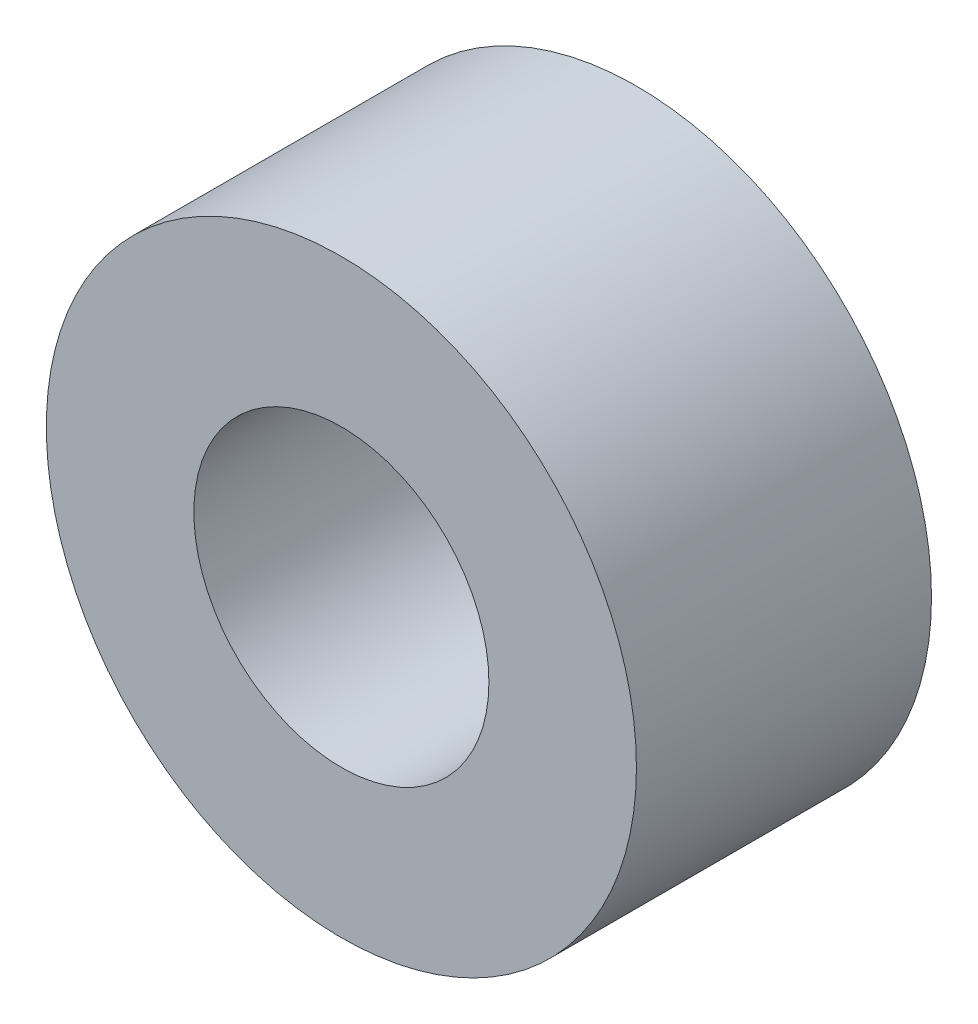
from build123d import *

# Parameters (mm, degrees)
SKIZZE1_R                       = 20
SKIZZE1_R_2                     = 10
AUFSATZ_LINEAR_AUSTRAGEN1_DEPTH = 20


with BuildPart() as part:
    # Skizze1 → Aufsatz-Linear austragen1 (new body)
    with BuildSketch(Plane.XY):
        Circle(SKIZZE1_R)
        Circle(SKIZZE1_R_2, mode=Mode.SUBTRACT)
    extrude(amount=AUFSATZ_LINEAR_AUSTRAGEN1_DEPTH)


solid = part.part
